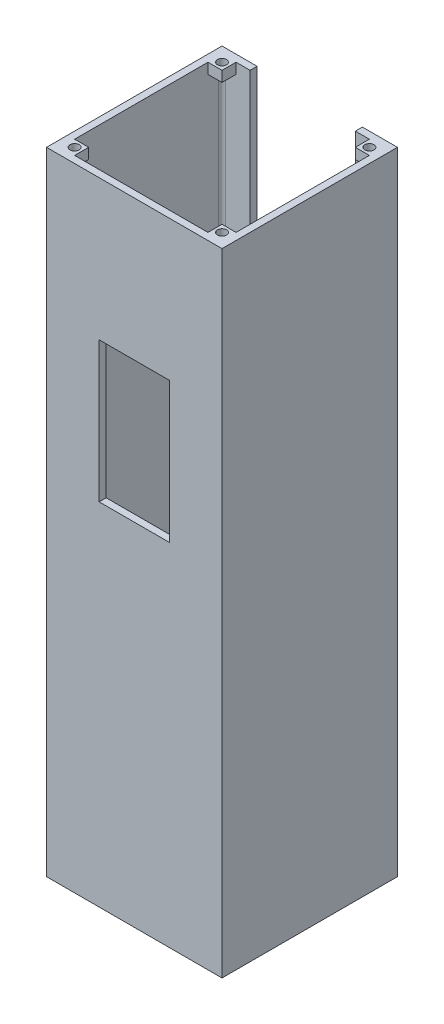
from build123d import *

# Parameters (mm, degrees)
SKETCH2_W           = 63.5
SKETCH2_H           = 63.5
BOSS_EXTRUDE2_DEPTH = 304.8
SKETCH3_W           = 58.42
SKETCH3_H           = 58.42
CUT_EXTRUDE2_DEPTH  = 302.26
SKETCH5_W           = 63.5
SKETCH5_H           = 63.5
CUT_EXTRUDE3_DEPTH  = 2.54
SKETCH6_R           = 12.7
CUT_EXTRUDE4_DEPTH  = 12.7
SKETCH11_R          = 12.7
CUT_EXTRUDE7_DEPTH  = 2.54
CUT_EXTRUDE8_DEPTH  = 2.54
SKETCH14_W          = 38.1
SKETCH14_H          = 276.86
CUT_EXTRUDE9_DEPTH  = 2.54
FILLET1_R           = 1.27
SKETCH15_W          = 63.5
SKETCH15_H          = 63.5
CUT_EXTRUDE10_DEPTH = 73.66
BOSS_EXTRUDE3_START = -3.81
SKETCH16_R          = 1.651
SKETCH16_W          = 5.08
SKETCH16_H          = 5.08
BOSS_EXTRUDE3_DEPTH = 3.81
CUT_EXTRUDE11_DEPTH = 3.81
CUT_EXTRUDE12_DEPTH = 5.08


with BuildPart() as part:
    # Sketch2 → Boss-Extrude2 (new body)
    with BuildSketch(Plane(origin=(0, 0, 0), x_dir=(1, 0, 0), z_dir=(0, 1, 0))):
        with Locations((31.75, 31.75)):
            Rectangle(SKETCH2_W, SKETCH2_H)
    extrude(amount=-BOSS_EXTRUDE2_DEPTH)

    # Sketch3 → Cut-Extrude2 (cut)
    with BuildSketch(Plane(origin=(0, 0, 0), x_dir=(1, 0, 0), z_dir=(0, 1, 0))):
        with Locations((31.75, 31.75)):
            Rectangle(SKETCH3_W, SKETCH3_H)
    extrude(amount=-CUT_EXTRUDE2_DEPTH, mode=Mode.SUBTRACT)

    # Sketch5 → Cut-Extrude3 (cut)
    with BuildSketch(Plane(origin=(0, 0, 0), x_dir=(1, 0, 0), z_dir=(0, 1, 0))):
        with Locations((31.75, 31.75)):
            Rectangle(SKETCH5_W, SKETCH5_H)
    extrude(amount=-CUT_EXTRUDE3_DEPTH, mode=Mode.SUBTRACT)

    # Sketch6 → Cut-Extrude4 (cut)
    with BuildSketch(Plane.XY):
        with Locations((31.75, -152.4)):
            Circle(SKETCH6_R)
    extrude(amount=-CUT_EXTRUDE4_DEPTH, mode=Mode.SUBTRACT)

    # Sketch11 → Cut-Extrude7 (cut)
    with BuildSketch(Plane.XY):
        with BuildLine():
            ThreePointArc((19.453277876, -155.575), (19.151222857, -154.000254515), (19.05, -152.4))
            Line((19.05, -152.4), (19.05, -158.75))
            ThreePointArc((19.05, -158.75), (19.151222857, -157.149745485), (19.453277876, -155.575))
        make_face()
        with Locations((31.75, -158.75)):
            Circle(SKETCH11_R)
        with Locations((31.75, -152.4)):
            Circle(SKETCH11_R)
        with BuildLine():
            Line((44.45, -158.75), (44.45, -152.4))
            ThreePointArc((44.45, -152.4), (44.348777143, -154.000254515), (44.046722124, -155.575))
            ThreePointArc((44.046722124, -155.575), (44.348777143, -157.149745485), (44.45, -158.75))
        make_face()
    extrude(amount=-CUT_EXTRUDE7_DEPTH, mode=Mode.SUBTRACT)

    # Sketch12 → Cut-Extrude8 (cut)
    with BuildSketch(Plane.XY):
        with BuildLine():
            ThreePointArc((44.45, -146.05), (31.75, -133.35), (19.05, -146.05))
            ThreePointArc((19.05, -146.05), (19.151222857, -147.650254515), (19.453277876, -149.225))
            ThreePointArc((19.453277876, -149.225), (31.75, -139.7), (44.046722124, -149.225))
            ThreePointArc((44.046722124, -149.225), (44.348777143, -147.650254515), (44.45, -146.05))
        make_face()
        with BuildLine():
            ThreePointArc((19.453277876, -149.225), (19.151222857, -147.650254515), (19.05, -146.05))
            Line((19.05, -146.05), (19.05, -152.4))
            ThreePointArc((19.05, -152.4), (19.151222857, -150.799745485), (19.453277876, -149.225))
        make_face()
        with BuildLine():
            Line((44.45, -152.4), (44.45, -146.05))
            ThreePointArc((44.45, -146.05), (44.348777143, -147.650254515), (44.046722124, -149.225))
            ThreePointArc((44.046722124, -149.225), (44.348777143, -150.799745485), (44.45, -152.4))
        make_face()
    extrude(amount=-CUT_EXTRUDE8_DEPTH, mode=Mode.SUBTRACT)

    # Sketch14 → Cut-Extrude9 (cut)
    with BuildSketch(Plane(origin=(0, 0, -63.5), x_dir=(-1, 0, 0), z_dir=(0, 0, -1))):
        with Locations((-31.75, -153.67)):
            Rectangle(SKETCH14_W, SKETCH14_H)
    extrude(amount=-CUT_EXTRUDE9_DEPTH, mode=Mode.SUBTRACT)

    # Fillet1
    fillet1_edges = [part.edges().sort_by_distance(p)[0] for p in [
        (60.96, -152.4, -2.54),
        (2.54, -152.4, -2.54),
        (2.54, -152.4, -60.96),
        (60.96, -152.4, -60.96),
    ]]
    fillet(fillet1_edges, radius=FILLET1_R)

    # Sketch15 → Cut-Extrude10 (cut)
    with BuildSketch(Plane(origin=(63.5, -2.54, 0), x_dir=(1, 0, 0), z_dir=(0, 1, 0))):
        with Locations((-31.75, 31.75)):
            Rectangle(SKETCH15_W, SKETCH15_H)
    extrude(amount=-CUT_EXTRUDE10_DEPTH, mode=Mode.SUBTRACT)

    # Sketch16 → Boss-Extrude3 (add)
    # profile 1 of 4: a face of its own
    with BuildSketch(Plane(origin=(0, -76.2, 0), x_dir=(1, 0, 0), z_dir=(0, 1, 0)).offset(BOSS_EXTRUDE3_START)):
        with BuildLine():
            Line((7.62, 60.96), (3.81, 60.96))
            ThreePointArc((3.81, 60.96), (2.911974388, 60.588025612), (2.54, 59.69))
            Line((2.54, 59.69), (2.54, 55.88))
            Line((2.54, 55.88), (7.62, 55.88))
            Line((7.62, 55.88), (7.62, 60.96))
        make_face()
        with Locations(Location((5.08, 58.42, 0), (0, 0, 270))):
            Circle(SKETCH16_R, mode=Mode.SUBTRACT)
    # profile 2 of 4: a face of its own
    with BuildSketch(Plane(origin=(0, -76.2, 0), x_dir=(1, 0, 0), z_dir=(0, 1, 0)).offset(BOSS_EXTRUDE3_START)):
        with BuildLine():
            Line((55.88, 55.88), (60.96, 55.88))
            Line((60.96, 55.88), (60.96, 59.69))
            ThreePointArc((60.96, 59.69), (60.588025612, 60.588025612), (59.69, 60.96))
            Line((59.69, 60.96), (55.88, 60.96))
            Line((55.88, 60.96), (55.88, 55.88))
        make_face()
        with Locations(Location((58.42, 58.42, 0), (0, 0, 270))):
            Circle(SKETCH16_R, mode=Mode.SUBTRACT)
    # profile 3 of 4: a face of its own
    with BuildSketch(Plane(origin=(0, -76.2, 0), x_dir=(1, 0, 0), z_dir=(0, 1, 0)).offset(BOSS_EXTRUDE3_START)):
        with BuildLine():
            Line((7.62, 7.62), (2.54, 7.62))
            Line((2.54, 7.62), (2.54, 3.81))
            ThreePointArc((2.54, 3.81), (2.911974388, 2.911974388), (3.81, 2.54))
            Line((3.81, 2.54), (7.62, 2.54))
            Line((7.62, 2.54), (7.62, 7.62))
        make_face()
        with Locations(Location((5.08, 5.08, 0), (0, 0, 270))):
            Circle(SKETCH16_R, mode=Mode.SUBTRACT)
    # profile 4 of 4: a face of its own
    with BuildSketch(Plane(origin=(0, -76.2, 0), x_dir=(1, 0, 0), z_dir=(0, 1, 0)).offset(BOSS_EXTRUDE3_START)):
        with Locations((58.42, 5.08)):
            Rectangle(SKETCH16_W, SKETCH16_H)
    extrude(amount=BOSS_EXTRUDE3_DEPTH)

    # Sketch17 → Cut-Extrude11 (cut)
    with BuildSketch(Plane(origin=(0, -76.2, 0), x_dir=(1, 0, 0), z_dir=(0, 1, 0))):
        with BuildLine():
            ThreePointArc((57.252566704, 6.247433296), (56.769, 5.08), (57.252566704, 3.912566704))
            Line((57.252566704, 3.912566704), (58.42, 5.08))
            Line((58.42, 5.08), (57.252566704, 6.247433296))
        make_face()
        with BuildLine():
            Line((58.42, 5.08), (57.252566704, 3.912566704))
            ThreePointArc((57.252566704, 3.912566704), (58.42, 3.429), (59.587433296, 3.912566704))
            Line((59.587433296, 3.912566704), (58.42, 5.08))
        make_face()
        with BuildLine():
            Line((57.252566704, 6.247433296), (58.42, 5.08))
            Line((58.42, 5.08), (59.587433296, 6.247433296))
            ThreePointArc((59.587433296, 6.247433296), (58.42, 6.731), (57.252566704, 6.247433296))
        make_face()
        with BuildLine():
            Line((59.587433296, 6.247433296), (58.42, 5.08))
            Line((58.42, 5.08), (59.587433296, 3.912566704))
            ThreePointArc((59.587433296, 3.912566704), (59.945325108, 4.448189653), (60.071, 5.08))
            ThreePointArc((60.071, 5.08), (59.945325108, 5.711810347), (59.587433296, 6.247433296))
        make_face()
        with BuildLine():
            ThreePointArc((57.252566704, 6.247433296), (56.769, 5.08), (57.252566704, 3.912566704))
            Line((57.252566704, 3.912566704), (58.42, 5.08))
            Line((58.42, 5.08), (57.252566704, 6.247433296))
        make_face()
        with BuildLine():
            Line((58.42, 5.08), (57.252566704, 3.912566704))
            ThreePointArc((57.252566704, 3.912566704), (58.42, 3.429), (59.587433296, 3.912566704))
            Line((59.587433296, 3.912566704), (58.42, 5.08))
        make_face()
        with BuildLine():
            Line((57.252566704, 6.247433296), (58.42, 5.08))
            Line((58.42, 5.08), (59.587433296, 6.247433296))
            ThreePointArc((59.587433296, 6.247433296), (58.42, 6.731), (57.252566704, 6.247433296))
        make_face()
        with BuildLine():
            Line((59.587433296, 6.247433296), (58.42, 5.08))
            Line((58.42, 5.08), (59.587433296, 3.912566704))
            ThreePointArc((59.587433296, 3.912566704), (59.945325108, 4.448189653), (60.071, 5.08))
            ThreePointArc((60.071, 5.08), (59.945325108, 5.711810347), (59.587433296, 6.247433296))
        make_face()
        with BuildLine():
            ThreePointArc((57.252566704, 6.247433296), (56.769, 5.08), (57.252566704, 3.912566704))
            Line((57.252566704, 3.912566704), (58.42, 5.08))
            Line((58.42, 5.08), (57.252566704, 6.247433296))
        make_face()
        with BuildLine():
            Line((58.42, 5.08), (57.252566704, 3.912566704))
            ThreePointArc((57.252566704, 3.912566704), (58.42, 3.429), (59.587433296, 3.912566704))
            Line((59.587433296, 3.912566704), (58.42, 5.08))
        make_face()
        with BuildLine():
            Line((57.252566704, 6.247433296), (58.42, 5.08))
            Line((58.42, 5.08), (59.587433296, 6.247433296))
            ThreePointArc((59.587433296, 6.247433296), (58.42, 6.731), (57.252566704, 6.247433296))
        make_face()
        with BuildLine():
            Line((59.587433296, 6.247433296), (58.42, 5.08))
            Line((58.42, 5.08), (59.587433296, 3.912566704))
            ThreePointArc((59.587433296, 3.912566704), (59.945325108, 4.448189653), (60.071, 5.08))
            ThreePointArc((60.071, 5.08), (59.945325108, 5.711810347), (59.587433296, 6.247433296))
        make_face()
        with BuildLine():
            ThreePointArc((57.252566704, 6.247433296), (56.769, 5.08), (57.252566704, 3.912566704))
            Line((57.252566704, 3.912566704), (58.42, 5.08))
            Line((58.42, 5.08), (57.252566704, 6.247433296))
        make_face()
        with BuildLine():
            Line((58.42, 5.08), (57.252566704, 3.912566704))
            ThreePointArc((57.252566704, 3.912566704), (58.42, 3.429), (59.587433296, 3.912566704))
            Line((59.587433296, 3.912566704), (58.42, 5.08))
        make_face()
        with BuildLine():
            Line((57.252566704, 6.247433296), (58.42, 5.08))
            Line((58.42, 5.08), (59.587433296, 6.247433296))
            ThreePointArc((59.587433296, 6.247433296), (58.42, 6.731), (57.252566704, 6.247433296))
        make_face()
        with BuildLine():
            Line((59.587433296, 6.247433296), (58.42, 5.08))
            Line((58.42, 5.08), (59.587433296, 3.912566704))
            ThreePointArc((59.587433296, 3.912566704), (59.945325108, 4.448189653), (60.071, 5.08))
            ThreePointArc((60.071, 5.08), (59.945325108, 5.711810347), (59.587433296, 6.247433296))
        make_face()
    extrude(amount=-CUT_EXTRUDE11_DEPTH, mode=Mode.SUBTRACT)

    # Sketch18 → Cut-Extrude12 (cut)
    with BuildSketch(Plane.XY):
        with BuildLine():
            ThreePointArc((31.75, -133.35), (40.730256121, -137.069743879), (44.45, -146.05))
            Line((44.45, -146.05), (44.45, -127))
            Line((44.45, -127), (31.75, -127))
            Line((31.75, -127), (31.75, -133.35))
        make_face()
        with BuildLine():
            ThreePointArc((19.05, -146.05), (22.769743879, -137.069743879), (31.75, -133.35))
            Line((31.75, -133.35), (31.75, -127))
            Line((31.75, -127), (19.05, -127))
            Line((19.05, -127), (19.05, -146.05))
        make_face()
        with BuildLine():
            Line((44.45, -177.8), (44.45, -158.75))
            ThreePointArc((44.45, -158.75), (40.730256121, -167.730256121), (31.75, -171.45))
            ThreePointArc((31.75, -171.45), (22.769743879, -167.730256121), (19.05, -158.75))
            Line((19.05, -158.75), (19.05, -177.8))
            Line((19.05, -177.8), (44.45, -177.8))
        make_face()
    extrude(amount=-CUT_EXTRUDE12_DEPTH, mode=Mode.SUBTRACT)


solid = part.part
